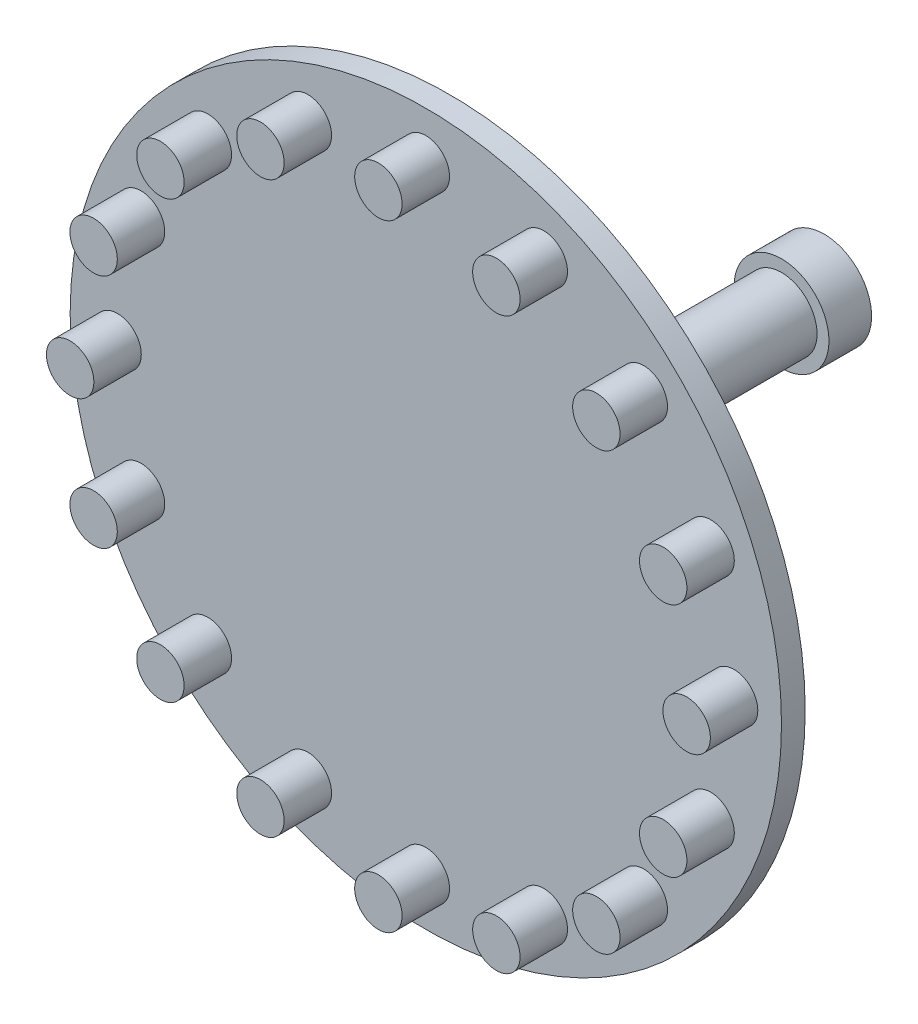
ISO-10303-21;
HEADER;
FILE_DESCRIPTION(('STEP AP214'),'2;1');
FILE_NAME('part.step','',(''),(''),'','','');
FILE_SCHEMA(('AUTOMOTIVE_DESIGN { 1 0 10303 214 1 1 1 1 }'));
ENDSEC;
DATA;
#1=APPLICATION_CONTEXT('core data for automotive mechanical design processes');
#2=APPLICATION_PROTOCOL_DEFINITION('international standard','automotive_design',2000,#1);
#3=PRODUCT_CONTEXT('',#1,'mechanical');
#4=PRODUCT('Part','Part','',(#3));
#5=PRODUCT_RELATED_PRODUCT_CATEGORY('part','',(#4));
#6=PRODUCT_DEFINITION_FORMATION('','',#4);
#7=PRODUCT_DEFINITION_CONTEXT('part definition',#1,'design');
#8=PRODUCT_DEFINITION('design','',#6,#7);
#9=PRODUCT_DEFINITION_SHAPE('','',#8);
#10=(LENGTH_UNIT() NAMED_UNIT(*) SI_UNIT(.MILLI.,.METRE.));
#11=(NAMED_UNIT(*) PLANE_ANGLE_UNIT() SI_UNIT($,.RADIAN.));
#12=(NAMED_UNIT(*) SI_UNIT($,.STERADIAN.) SOLID_ANGLE_UNIT());
#13=UNCERTAINTY_MEASURE_WITH_UNIT(LENGTH_MEASURE(1.E-05),#10,'distance_accuracy_value','');
#14=(GEOMETRIC_REPRESENTATION_CONTEXT(3) GLOBAL_UNCERTAINTY_ASSIGNED_CONTEXT((#13)) GLOBAL_UNIT_ASSIGNED_CONTEXT((#10,
#11,#12)) REPRESENTATION_CONTEXT('',''));
#15=CARTESIAN_POINT('',(0.,0.,0.));
#16=DIRECTION('',(0.,0.,1.));
#17=DIRECTION('',(1.,0.,0.));
#18=AXIS2_PLACEMENT_3D('',#15,#16,#17);
#19=CARTESIAN_POINT('',(0.,0.,70.));
#20=DIRECTION('',(0.,0.,-1.));
#21=DIRECTION('',(-1.,0.,0.));
#22=AXIS2_PLACEMENT_3D('',#19,#20,#21);
#23=CYLINDRICAL_SURFACE('',#22,7.5);
#24=CARTESIAN_POINT('',(0.,0.,70.));
#25=DIRECTION('',(0.,0.,1.));
#26=DIRECTION('',(1.,0.,0.));
#27=AXIS2_PLACEMENT_3D('',#24,#25,#26);
#28=CIRCLE('',#27,7.5);
#29=CARTESIAN_POINT('',(7.5,0.,70.));
#30=VERTEX_POINT('',#29);
#31=EDGE_CURVE('E11',#30,#30,#28,.T.);
#32=ORIENTED_EDGE('',*,*,#31,.F.);
#33=EDGE_LOOP('',(#32));
#34=FACE_BOUND('',#33,.T.);
#35=CARTESIAN_POINT('',(0.,0.,0.));
#36=DIRECTION('',(0.,0.,1.));
#37=DIRECTION('',(1.,0.,0.));
#38=AXIS2_PLACEMENT_3D('',#35,#36,#37);
#39=CIRCLE('',#38,7.5);
#40=CARTESIAN_POINT('',(7.5,0.,0.));
#41=VERTEX_POINT('',#40);
#42=EDGE_CURVE('E62',#41,#41,#39,.T.);
#43=ORIENTED_EDGE('',*,*,#42,.T.);
#44=EDGE_LOOP('',(#43));
#45=FACE_BOUND('',#44,.T.);
#46=ADVANCED_FACE('F59',(#34,#45),#23,.T.);
#47=CARTESIAN_POINT('',(0.,0.,75.));
#48=DIRECTION('',(0.,0.,-1.));
#49=DIRECTION('',(-1.,0.,0.));
#50=AXIS2_PLACEMENT_3D('',#47,#48,#49);
#51=CYLINDRICAL_SURFACE('',#50,75.);
#52=CARTESIAN_POINT('',(0.,0.,75.));
#53=DIRECTION('',(0.,0.,1.));
#54=DIRECTION('',(1.,0.,0.));
#55=AXIS2_PLACEMENT_3D('',#52,#53,#54);
#56=CIRCLE('',#55,75.);
#57=CARTESIAN_POINT('',(75.,0.,75.));
#58=VERTEX_POINT('',#57);
#59=EDGE_CURVE('E67',#58,#58,#56,.T.);
#60=ORIENTED_EDGE('',*,*,#59,.F.);
#61=EDGE_LOOP('',(#60));
#62=FACE_BOUND('',#61,.T.);
#63=CARTESIAN_POINT('',(0.,0.,70.));
#64=DIRECTION('',(0.,0.,1.));
#65=DIRECTION('',(1.,0.,0.));
#66=AXIS2_PLACEMENT_3D('',#63,#64,#65);
#67=CIRCLE('',#66,75.);
#68=CARTESIAN_POINT('',(75.,0.,70.));
#69=VERTEX_POINT('',#68);
#70=EDGE_CURVE('E72',#69,#69,#67,.T.);
#71=ORIENTED_EDGE('',*,*,#70,.T.);
#72=EDGE_LOOP('',(#71));
#73=FACE_BOUND('',#72,.T.);
#74=ADVANCED_FACE('F230',(#62,#73),#51,.T.);
#75=CARTESIAN_POINT('',(0.,0.,75.));
#76=DIRECTION('',(0.,0.,1.));
#77=DIRECTION('',(1.,0.,0.));
#78=AXIS2_PLACEMENT_3D('',#75,#76,#77);
#79=PLANE('',#78);
#80=CARTESIAN_POINT('',(45.9619407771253,-45.9619407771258,75.));
#81=DIRECTION('',(0.,0.,1.));
#82=DIRECTION('',(1.,0.,0.));
#83=AXIS2_PLACEMENT_3D('',#80,#81,#82);
#84=CIRCLE('',#83,4.99999999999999);
#85=CARTESIAN_POINT('',(50.9619407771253,-45.9619407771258,75.));
#86=VERTEX_POINT('',#85);
#87=EDGE_CURVE('E211',#86,#86,#84,.T.);
#88=ORIENTED_EDGE('',*,*,#87,.F.);
#89=EDGE_LOOP('',(#88));
#90=FACE_BOUND('',#89,.T.);
#91=CARTESIAN_POINT('',(60.0521696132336,-24.8744231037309,75.));
#92=DIRECTION('',(0.,0.,1.));
#93=DIRECTION('',(1.,0.,0.));
#94=AXIS2_PLACEMENT_3D('',#91,#92,#93);
#95=CIRCLE('',#94,5.);
#96=CARTESIAN_POINT('',(65.0521696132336,-24.8744231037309,75.));
#97=VERTEX_POINT('',#96);
#98=EDGE_CURVE('E203',#97,#97,#95,.T.);
#99=ORIENTED_EDGE('',*,*,#98,.F.);
#100=EDGE_LOOP('',(#99));
#101=FACE_BOUND('',#100,.T.);
#102=CARTESIAN_POINT('',(65.,0.,75.));
#103=DIRECTION('',(0.,0.,1.));
#104=DIRECTION('',(1.,0.,0.));
#105=AXIS2_PLACEMENT_3D('',#102,#103,#104);
#106=CIRCLE('',#105,5.);
#107=CARTESIAN_POINT('',(70.,0.,75.));
#108=VERTEX_POINT('',#107);
#109=EDGE_CURVE('E195',#108,#108,#106,.T.);
#110=ORIENTED_EDGE('',*,*,#109,.F.);
#111=EDGE_LOOP('',(#110));
#112=FACE_BOUND('',#111,.T.);
#113=CARTESIAN_POINT('',(60.0521696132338,24.8744231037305,75.));
#114=DIRECTION('',(0.,0.,1.));
#115=DIRECTION('',(1.,0.,0.));
#116=AXIS2_PLACEMENT_3D('',#113,#114,#115);
#117=CIRCLE('',#116,5.);
#118=CARTESIAN_POINT('',(65.0521696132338,24.8744231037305,75.));
#119=VERTEX_POINT('',#118);
#120=EDGE_CURVE('E187',#119,#119,#117,.T.);
#121=ORIENTED_EDGE('',*,*,#120,.F.);
#122=EDGE_LOOP('',(#121));
#123=FACE_BOUND('',#122,.T.);
#124=CARTESIAN_POINT('',(45.9619407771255,45.9619407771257,75.));
#125=DIRECTION('',(0.,0.,1.));
#126=DIRECTION('',(1.,0.,0.));
#127=AXIS2_PLACEMENT_3D('',#124,#125,#126);
#128=CIRCLE('',#127,5.);
#129=CARTESIAN_POINT('',(50.9619407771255,45.9619407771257,75.));
#130=VERTEX_POINT('',#129);
#131=EDGE_CURVE('E179',#130,#130,#128,.T.);
#132=ORIENTED_EDGE('',*,*,#131,.F.);
#133=EDGE_LOOP('',(#132));
#134=FACE_BOUND('',#133,.T.);
#135=CARTESIAN_POINT('',(24.8744231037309,60.0521696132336,75.));
#136=DIRECTION('',(0.,0.,1.));
#137=DIRECTION('',(1.,0.,0.));
#138=AXIS2_PLACEMENT_3D('',#135,#136,#137);
#139=CIRCLE('',#138,5.);
#140=CARTESIAN_POINT('',(29.8744231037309,60.0521696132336,75.));
#141=VERTEX_POINT('',#140);
#142=EDGE_CURVE('E171',#141,#141,#139,.T.);
#143=ORIENTED_EDGE('',*,*,#142,.F.);
#144=EDGE_LOOP('',(#143));
#145=FACE_BOUND('',#144,.T.);
#146=CARTESIAN_POINT('',(0.,65.,75.));
#147=DIRECTION('',(0.,0.,1.));
#148=DIRECTION('',(1.,0.,0.));
#149=AXIS2_PLACEMENT_3D('',#146,#147,#148);
#150=CIRCLE('',#149,5.);
#151=CARTESIAN_POINT('',(5.,65.,75.));
#152=VERTEX_POINT('',#151);
#153=EDGE_CURVE('E163',#152,#152,#150,.T.);
#154=ORIENTED_EDGE('',*,*,#153,.F.);
#155=EDGE_LOOP('',(#154));
#156=FACE_BOUND('',#155,.T.);
#157=CARTESIAN_POINT('',(-24.8744231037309,60.0521696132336,75.));
#158=DIRECTION('',(0.,0.,1.));
#159=DIRECTION('',(1.,0.,0.));
#160=AXIS2_PLACEMENT_3D('',#157,#158,#159);
#161=CIRCLE('',#160,5.);
#162=CARTESIAN_POINT('',(-19.8744231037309,60.0521696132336,75.));
#163=VERTEX_POINT('',#162);
#164=EDGE_CURVE('E155',#163,#163,#161,.T.);
#165=ORIENTED_EDGE('',*,*,#164,.F.);
#166=EDGE_LOOP('',(#165));
#167=FACE_BOUND('',#166,.T.);
#168=CARTESIAN_POINT('',(-45.9619407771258,45.9619407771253,75.));
#169=DIRECTION('',(0.,0.,1.));
#170=DIRECTION('',(1.,0.,0.));
#171=AXIS2_PLACEMENT_3D('',#168,#169,#170);
#172=CIRCLE('',#171,5.);
#173=CARTESIAN_POINT('',(-40.9619407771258,45.9619407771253,75.));
#174=VERTEX_POINT('',#173);
#175=EDGE_CURVE('E147',#174,#174,#172,.T.);
#176=ORIENTED_EDGE('',*,*,#175,.F.);
#177=EDGE_LOOP('',(#176));
#178=FACE_BOUND('',#177,.T.);
#179=CARTESIAN_POINT('',(-45.9619407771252,-45.961940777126,75.));
#180=DIRECTION('',(0.,0.,1.));
#181=DIRECTION('',(1.,0.,0.));
#182=AXIS2_PLACEMENT_3D('',#179,#180,#181);
#183=CIRCLE('',#182,5.);
#184=CARTESIAN_POINT('',(-40.9619407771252,-45.961940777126,75.));
#185=VERTEX_POINT('',#184);
#186=EDGE_CURVE('E139',#185,#185,#183,.T.);
#187=ORIENTED_EDGE('',*,*,#186,.F.);
#188=EDGE_LOOP('',(#187));
#189=FACE_BOUND('',#188,.T.);
#190=CARTESIAN_POINT('',(-60.0521696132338,-24.8744231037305,75.));
#191=DIRECTION('',(0.,0.,1.));
#192=DIRECTION('',(1.,0.,0.));
#193=AXIS2_PLACEMENT_3D('',#190,#191,#192);
#194=CIRCLE('',#193,5.);
#195=CARTESIAN_POINT('',(-55.0521696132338,-24.8744231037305,75.));
#196=VERTEX_POINT('',#195);
#197=EDGE_CURVE('E131',#196,#196,#194,.T.);
#198=ORIENTED_EDGE('',*,*,#197,.F.);
#199=EDGE_LOOP('',(#198));
#200=FACE_BOUND('',#199,.T.);
#201=CARTESIAN_POINT('',(-65.,0.,75.));
#202=DIRECTION('',(0.,0.,1.));
#203=DIRECTION('',(1.,0.,0.));
#204=AXIS2_PLACEMENT_3D('',#201,#202,#203);
#205=CIRCLE('',#204,5.);
#206=CARTESIAN_POINT('',(-60.,0.,75.));
#207=VERTEX_POINT('',#206);
#208=EDGE_CURVE('E123',#207,#207,#205,.T.);
#209=ORIENTED_EDGE('',*,*,#208,.F.);
#210=EDGE_LOOP('',(#209));
#211=FACE_BOUND('',#210,.T.);
#212=CARTESIAN_POINT('',(-60.0521696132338,24.8744231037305,75.));
#213=DIRECTION('',(0.,0.,1.));
#214=DIRECTION('',(1.,0.,0.));
#215=AXIS2_PLACEMENT_3D('',#212,#213,#214);
#216=CIRCLE('',#215,5.);
#217=CARTESIAN_POINT('',(-55.0521696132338,24.8744231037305,75.));
#218=VERTEX_POINT('',#217);
#219=EDGE_CURVE('E115',#218,#218,#216,.T.);
#220=ORIENTED_EDGE('',*,*,#219,.F.);
#221=EDGE_LOOP('',(#220));
#222=FACE_BOUND('',#221,.T.);
#223=CARTESIAN_POINT('',(24.8744231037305,-60.0521696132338,75.));
#224=DIRECTION('',(0.,0.,1.));
#225=DIRECTION('',(1.,0.,0.));
#226=AXIS2_PLACEMENT_3D('',#223,#224,#225);
#227=CIRCLE('',#226,5.);
#228=CARTESIAN_POINT('',(29.8744231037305,-60.0521696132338,75.));
#229=VERTEX_POINT('',#228);
#230=EDGE_CURVE('E107',#229,#229,#227,.T.);
#231=ORIENTED_EDGE('',*,*,#230,.F.);
#232=EDGE_LOOP('',(#231));
#233=FACE_BOUND('',#232,.T.);
#234=CARTESIAN_POINT('',(0.,-65.,75.));
#235=DIRECTION('',(0.,0.,1.));
#236=DIRECTION('',(1.,0.,0.));
#237=AXIS2_PLACEMENT_3D('',#234,#235,#236);
#238=CIRCLE('',#237,5.);
#239=CARTESIAN_POINT('',(5.,-65.,75.));
#240=VERTEX_POINT('',#239);
#241=EDGE_CURVE('E99',#240,#240,#238,.T.);
#242=ORIENTED_EDGE('',*,*,#241,.F.);
#243=EDGE_LOOP('',(#242));
#244=FACE_BOUND('',#243,.T.);
#245=CARTESIAN_POINT('',(-24.8744231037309,-60.0521696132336,75.));
#246=DIRECTION('',(0.,0.,1.));
#247=DIRECTION('',(1.,0.,0.));
#248=AXIS2_PLACEMENT_3D('',#245,#246,#247);
#249=CIRCLE('',#248,5.);
#250=CARTESIAN_POINT('',(-19.8744231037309,-60.0521696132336,75.));
#251=VERTEX_POINT('',#250);
#252=EDGE_CURVE('E95',#251,#251,#249,.T.);
#253=ORIENTED_EDGE('',*,*,#252,.F.);
#254=EDGE_LOOP('',(#253));
#255=FACE_BOUND('',#254,.T.);
#256=ORIENTED_EDGE('',*,*,#59,.T.);
#257=EDGE_LOOP('',(#256));
#258=FACE_BOUND('',#257,.T.);
#259=ADVANCED_FACE('F226',(#90,#101,#112,#123,#134,#145,#156,#167,#178,#189,#200,#211,#222,#233,
#244,#255,#258),#79,.T.);
#260=CARTESIAN_POINT('',(0.,0.,70.));
#261=DIRECTION('',(0.,0.,1.));
#262=DIRECTION('',(1.,0.,0.));
#263=AXIS2_PLACEMENT_3D('',#260,#261,#262);
#264=PLANE('',#263);
#265=ORIENTED_EDGE('',*,*,#31,.T.);
#266=EDGE_LOOP('',(#265));
#267=FACE_BOUND('',#266,.T.);
#268=ORIENTED_EDGE('',*,*,#70,.F.);
#269=EDGE_LOOP('',(#268));
#270=FACE_BOUND('',#269,.T.);
#271=ADVANCED_FACE('F229',(#267,#270),#264,.F.);
#272=CARTESIAN_POINT('',(0.,0.,-9.));
#273=DIRECTION('',(0.,0.,1.));
#274=DIRECTION('',(1.,0.,0.));
#275=AXIS2_PLACEMENT_3D('',#272,#273,#274);
#276=CYLINDRICAL_SURFACE('',#275,10.);
#277=CARTESIAN_POINT('',(0.,0.,-9.));
#278=DIRECTION('',(0.,0.,-1.));
#279=DIRECTION('',(-1.,0.,0.));
#280=AXIS2_PLACEMENT_3D('',#277,#278,#279);
#281=CIRCLE('',#280,10.);
#282=CARTESIAN_POINT('',(-10.,0.,-9.));
#283=VERTEX_POINT('',#282);
#284=EDGE_CURVE('E82',#283,#283,#281,.T.);
#285=ORIENTED_EDGE('',*,*,#284,.F.);
#286=EDGE_LOOP('',(#285));
#287=FACE_BOUND('',#286,.T.);
#288=CARTESIAN_POINT('',(0.,0.,0.));
#289=DIRECTION('',(0.,0.,-1.));
#290=DIRECTION('',(-1.,0.,0.));
#291=AXIS2_PLACEMENT_3D('',#288,#289,#290);
#292=CIRCLE('',#291,10.);
#293=CARTESIAN_POINT('',(-10.,0.,0.));
#294=VERTEX_POINT('',#293);
#295=EDGE_CURVE('E78',#294,#294,#292,.T.);
#296=ORIENTED_EDGE('',*,*,#295,.T.);
#297=EDGE_LOOP('',(#296));
#298=FACE_BOUND('',#297,.T.);
#299=ADVANCED_FACE('F269',(#287,#298),#276,.T.);
#300=CARTESIAN_POINT('',(0.,0.,-9.));
#301=DIRECTION('',(0.,0.,-1.));
#302=DIRECTION('',(-1.,0.,0.));
#303=AXIS2_PLACEMENT_3D('',#300,#301,#302);
#304=PLANE('',#303);
#305=CARTESIAN_POINT('',(0.,0.,-9.));
#306=DIRECTION('',(0.,0.,-1.));
#307=DIRECTION('',(-1.,0.,0.));
#308=AXIS2_PLACEMENT_3D('',#305,#306,#307);
#309=CIRCLE('',#308,2.5);
#310=CARTESIAN_POINT('',(-2.5,0.,-9.));
#311=VERTEX_POINT('',#310);
#312=EDGE_CURVE('E87',#311,#311,#309,.T.);
#313=ORIENTED_EDGE('',*,*,#312,.F.);
#314=EDGE_LOOP('',(#313));
#315=FACE_BOUND('',#314,.T.);
#316=ORIENTED_EDGE('',*,*,#284,.T.);
#317=EDGE_LOOP('',(#316));
#318=FACE_BOUND('',#317,.T.);
#319=ADVANCED_FACE('F274',(#315,#318),#304,.T.);
#320=CARTESIAN_POINT('',(0.,0.,0.));
#321=DIRECTION('',(0.,0.,-1.));
#322=DIRECTION('',(-1.,0.,0.));
#323=AXIS2_PLACEMENT_3D('',#320,#321,#322);
#324=PLANE('',#323);
#325=ORIENTED_EDGE('',*,*,#42,.F.);
#326=EDGE_LOOP('',(#325));
#327=FACE_BOUND('',#326,.T.);
#328=ORIENTED_EDGE('',*,*,#295,.F.);
#329=EDGE_LOOP('',(#328));
#330=FACE_BOUND('',#329,.T.);
#331=ADVANCED_FACE('F286',(#327,#330),#324,.F.);
#332=CARTESIAN_POINT('',(0.,0.,-4.));
#333=DIRECTION('',(0.,0.,-1.));
#334=DIRECTION('',(-1.,0.,0.));
#335=AXIS2_PLACEMENT_3D('',#332,#333,#334);
#336=CYLINDRICAL_SURFACE('',#335,2.5);
#337=CARTESIAN_POINT('',(0.,0.,-4.));
#338=DIRECTION('',(0.,0.,-1.));
#339=DIRECTION('',(-1.,0.,0.));
#340=AXIS2_PLACEMENT_3D('',#337,#338,#339);
#341=CIRCLE('',#340,2.5);
#342=CARTESIAN_POINT('',(-2.5,0.,-4.));
#343=VERTEX_POINT('',#342);
#344=EDGE_CURVE('E83',#343,#343,#341,.T.);
#345=ORIENTED_EDGE('',*,*,#344,.F.);
#346=EDGE_LOOP('',(#345));
#347=FACE_BOUND('',#346,.T.);
#348=ORIENTED_EDGE('',*,*,#312,.T.);
#349=EDGE_LOOP('',(#348));
#350=FACE_BOUND('',#349,.T.);
#351=ADVANCED_FACE('F289',(#347,#350),#336,.F.);
#352=CARTESIAN_POINT('',(0.,0.,-4.));
#353=DIRECTION('',(0.,0.,-1.));
#354=DIRECTION('',(-1.,0.,0.));
#355=AXIS2_PLACEMENT_3D('',#352,#353,#354);
#356=PLANE('',#355);
#357=ORIENTED_EDGE('',*,*,#344,.T.);
#358=EDGE_LOOP('',(#357));
#359=FACE_BOUND('',#358,.T.);
#360=ADVANCED_FACE('F297',(#359),#356,.T.);
#361=CARTESIAN_POINT('',(-24.8744231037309,-60.0521696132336,85.));
#362=DIRECTION('',(0.,0.,-1.));
#363=DIRECTION('',(-1.,0.,0.));
#364=AXIS2_PLACEMENT_3D('',#361,#362,#363);
#365=CYLINDRICAL_SURFACE('',#364,5.);
#366=CARTESIAN_POINT('',(-24.8744231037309,-60.0521696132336,85.));
#367=DIRECTION('',(0.,0.,1.));
#368=DIRECTION('',(1.,0.,0.));
#369=AXIS2_PLACEMENT_3D('',#366,#367,#368);
#370=CIRCLE('',#369,5.);
#371=CARTESIAN_POINT('',(-19.8744231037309,-60.0521696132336,85.));
#372=VERTEX_POINT('',#371);
#373=EDGE_CURVE('E91',#372,#372,#370,.T.);
#374=ORIENTED_EDGE('',*,*,#373,.F.);
#375=EDGE_LOOP('',(#374));
#376=FACE_BOUND('',#375,.T.);
#377=ORIENTED_EDGE('',*,*,#252,.T.);
#378=EDGE_LOOP('',(#377));
#379=FACE_BOUND('',#378,.T.);
#380=ADVANCED_FACE('F305',(#376,#379),#365,.T.);
#381=CARTESIAN_POINT('',(0.,0.,85.));
#382=DIRECTION('',(0.,0.,1.));
#383=DIRECTION('',(1.,0.,0.));
#384=AXIS2_PLACEMENT_3D('',#381,#382,#383);
#385=PLANE('',#384);
#386=ORIENTED_EDGE('',*,*,#373,.T.);
#387=EDGE_LOOP('',(#386));
#388=FACE_BOUND('',#387,.T.);
#389=ADVANCED_FACE('F309',(#388),#385,.T.);
#390=CARTESIAN_POINT('',(0.,-65.,85.));
#391=DIRECTION('',(0.,0.,-1.));
#392=DIRECTION('',(-1.,0.,0.));
#393=AXIS2_PLACEMENT_3D('',#390,#391,#392);
#394=CYLINDRICAL_SURFACE('',#393,5.);
#395=CARTESIAN_POINT('',(0.,-65.,85.));
#396=DIRECTION('',(0.,0.,1.));
#397=DIRECTION('',(1.,0.,0.));
#398=AXIS2_PLACEMENT_3D('',#395,#396,#397);
#399=CIRCLE('',#398,5.);
#400=CARTESIAN_POINT('',(5.,-65.,85.));
#401=VERTEX_POINT('',#400);
#402=EDGE_CURVE('E103',#401,#401,#399,.T.);
#403=ORIENTED_EDGE('',*,*,#402,.F.);
#404=EDGE_LOOP('',(#403));
#405=FACE_BOUND('',#404,.T.);
#406=ORIENTED_EDGE('',*,*,#241,.T.);
#407=EDGE_LOOP('',(#406));
#408=FACE_BOUND('',#407,.T.);
#409=ADVANCED_FACE('F313',(#405,#408),#394,.T.);
#410=CARTESIAN_POINT('',(0.,0.,85.));
#411=DIRECTION('',(0.,0.,1.));
#412=DIRECTION('',(1.,0.,0.));
#413=AXIS2_PLACEMENT_3D('',#410,#411,#412);
#414=PLANE('',#413);
#415=ORIENTED_EDGE('',*,*,#402,.T.);
#416=EDGE_LOOP('',(#415));
#417=FACE_BOUND('',#416,.T.);
#418=ADVANCED_FACE('F315',(#417),#414,.T.);
#419=CARTESIAN_POINT('',(24.8744231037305,-60.0521696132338,85.));
#420=DIRECTION('',(0.,0.,-1.));
#421=DIRECTION('',(-1.,0.,0.));
#422=AXIS2_PLACEMENT_3D('',#419,#420,#421);
#423=CYLINDRICAL_SURFACE('',#422,5.);
#424=CARTESIAN_POINT('',(24.8744231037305,-60.0521696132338,85.));
#425=DIRECTION('',(0.,0.,1.));
#426=DIRECTION('',(1.,0.,0.));
#427=AXIS2_PLACEMENT_3D('',#424,#425,#426);
#428=CIRCLE('',#427,5.);
#429=CARTESIAN_POINT('',(29.8744231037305,-60.0521696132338,85.));
#430=VERTEX_POINT('',#429);
#431=EDGE_CURVE('E111',#430,#430,#428,.T.);
#432=ORIENTED_EDGE('',*,*,#431,.F.);
#433=EDGE_LOOP('',(#432));
#434=FACE_BOUND('',#433,.T.);
#435=ORIENTED_EDGE('',*,*,#230,.T.);
#436=EDGE_LOOP('',(#435));
#437=FACE_BOUND('',#436,.T.);
#438=ADVANCED_FACE('F318',(#434,#437),#423,.T.);
#439=CARTESIAN_POINT('',(0.,0.,85.));
#440=DIRECTION('',(0.,0.,1.));
#441=DIRECTION('',(1.,0.,0.));
#442=AXIS2_PLACEMENT_3D('',#439,#440,#441);
#443=PLANE('',#442);
#444=ORIENTED_EDGE('',*,*,#431,.T.);
#445=EDGE_LOOP('',(#444));
#446=FACE_BOUND('',#445,.T.);
#447=ADVANCED_FACE('F323',(#446),#443,.T.);
#448=CARTESIAN_POINT('',(-60.0521696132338,24.8744231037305,85.));
#449=DIRECTION('',(0.,0.,-1.));
#450=DIRECTION('',(-1.,0.,0.));
#451=AXIS2_PLACEMENT_3D('',#448,#449,#450);
#452=CYLINDRICAL_SURFACE('',#451,5.);
#453=ORIENTED_EDGE('',*,*,#219,.T.);
#454=EDGE_LOOP('',(#453));
#455=FACE_BOUND('',#454,.T.);
#456=CARTESIAN_POINT('',(-60.0521696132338,24.8744231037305,85.));
#457=DIRECTION('',(0.,0.,1.));
#458=DIRECTION('',(1.,0.,0.));
#459=AXIS2_PLACEMENT_3D('',#456,#457,#458);
#460=CIRCLE('',#459,5.);
#461=CARTESIAN_POINT('',(-55.0521696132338,24.8744231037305,85.));
#462=VERTEX_POINT('',#461);
#463=EDGE_CURVE('E119',#462,#462,#460,.T.);
#464=ORIENTED_EDGE('',*,*,#463,.F.);
#465=EDGE_LOOP('',(#464));
#466=FACE_BOUND('',#465,.T.);
#467=ADVANCED_FACE('F326',(#455,#466),#452,.T.);
#468=CARTESIAN_POINT('',(0.,0.,85.));
#469=DIRECTION('',(0.,0.,1.));
#470=DIRECTION('',(1.,0.,0.));
#471=AXIS2_PLACEMENT_3D('',#468,#469,#470);
#472=PLANE('',#471);
#473=ORIENTED_EDGE('',*,*,#463,.T.);
#474=EDGE_LOOP('',(#473));
#475=FACE_BOUND('',#474,.T.);
#476=ADVANCED_FACE('F331',(#475),#472,.T.);
#477=CARTESIAN_POINT('',(-65.,0.,85.));
#478=DIRECTION('',(0.,0.,-1.));
#479=DIRECTION('',(-1.,0.,0.));
#480=AXIS2_PLACEMENT_3D('',#477,#478,#479);
#481=CYLINDRICAL_SURFACE('',#480,5.);
#482=CARTESIAN_POINT('',(-65.,0.,85.));
#483=DIRECTION('',(0.,0.,1.));
#484=DIRECTION('',(1.,0.,0.));
#485=AXIS2_PLACEMENT_3D('',#482,#483,#484);
#486=CIRCLE('',#485,5.);
#487=CARTESIAN_POINT('',(-60.,0.,85.));
#488=VERTEX_POINT('',#487);
#489=EDGE_CURVE('E127',#488,#488,#486,.T.);
#490=ORIENTED_EDGE('',*,*,#489,.F.);
#491=EDGE_LOOP('',(#490));
#492=FACE_BOUND('',#491,.T.);
#493=ORIENTED_EDGE('',*,*,#208,.T.);
#494=EDGE_LOOP('',(#493));
#495=FACE_BOUND('',#494,.T.);
#496=ADVANCED_FACE('F334',(#492,#495),#481,.T.);
#497=CARTESIAN_POINT('',(0.,0.,85.));
#498=DIRECTION('',(0.,0.,1.));
#499=DIRECTION('',(1.,0.,0.));
#500=AXIS2_PLACEMENT_3D('',#497,#498,#499);
#501=PLANE('',#500);
#502=ORIENTED_EDGE('',*,*,#489,.T.);
#503=EDGE_LOOP('',(#502));
#504=FACE_BOUND('',#503,.T.);
#505=ADVANCED_FACE('F339',(#504),#501,.T.);
#506=CARTESIAN_POINT('',(-60.0521696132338,-24.8744231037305,85.));
#507=DIRECTION('',(0.,0.,-1.));
#508=DIRECTION('',(-1.,0.,0.));
#509=AXIS2_PLACEMENT_3D('',#506,#507,#508);
#510=CYLINDRICAL_SURFACE('',#509,5.);
#511=CARTESIAN_POINT('',(-60.0521696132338,-24.8744231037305,85.));
#512=DIRECTION('',(0.,0.,1.));
#513=DIRECTION('',(1.,0.,0.));
#514=AXIS2_PLACEMENT_3D('',#511,#512,#513);
#515=CIRCLE('',#514,5.);
#516=CARTESIAN_POINT('',(-55.0521696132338,-24.8744231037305,85.));
#517=VERTEX_POINT('',#516);
#518=EDGE_CURVE('E135',#517,#517,#515,.T.);
#519=ORIENTED_EDGE('',*,*,#518,.F.);
#520=EDGE_LOOP('',(#519));
#521=FACE_BOUND('',#520,.T.);
#522=ORIENTED_EDGE('',*,*,#197,.T.);
#523=EDGE_LOOP('',(#522));
#524=FACE_BOUND('',#523,.T.);
#525=ADVANCED_FACE('F342',(#521,#524),#510,.T.);
#526=CARTESIAN_POINT('',(0.,0.,85.));
#527=DIRECTION('',(0.,0.,1.));
#528=DIRECTION('',(1.,0.,0.));
#529=AXIS2_PLACEMENT_3D('',#526,#527,#528);
#530=PLANE('',#529);
#531=ORIENTED_EDGE('',*,*,#518,.T.);
#532=EDGE_LOOP('',(#531));
#533=FACE_BOUND('',#532,.T.);
#534=ADVANCED_FACE('F347',(#533),#530,.T.);
#535=CARTESIAN_POINT('',(-45.9619407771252,-45.961940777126,85.));
#536=DIRECTION('',(0.,0.,-1.));
#537=DIRECTION('',(-1.,0.,0.));
#538=AXIS2_PLACEMENT_3D('',#535,#536,#537);
#539=CYLINDRICAL_SURFACE('',#538,5.);
#540=CARTESIAN_POINT('',(-45.9619407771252,-45.961940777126,85.));
#541=DIRECTION('',(0.,0.,1.));
#542=DIRECTION('',(1.,0.,0.));
#543=AXIS2_PLACEMENT_3D('',#540,#541,#542);
#544=CIRCLE('',#543,5.);
#545=CARTESIAN_POINT('',(-40.9619407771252,-45.961940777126,85.));
#546=VERTEX_POINT('',#545);
#547=EDGE_CURVE('E143',#546,#546,#544,.T.);
#548=ORIENTED_EDGE('',*,*,#547,.F.);
#549=EDGE_LOOP('',(#548));
#550=FACE_BOUND('',#549,.T.);
#551=ORIENTED_EDGE('',*,*,#186,.T.);
#552=EDGE_LOOP('',(#551));
#553=FACE_BOUND('',#552,.T.);
#554=ADVANCED_FACE('F350',(#550,#553),#539,.T.);
#555=CARTESIAN_POINT('',(0.,0.,85.));
#556=DIRECTION('',(0.,0.,1.));
#557=DIRECTION('',(1.,0.,0.));
#558=AXIS2_PLACEMENT_3D('',#555,#556,#557);
#559=PLANE('',#558);
#560=ORIENTED_EDGE('',*,*,#547,.T.);
#561=EDGE_LOOP('',(#560));
#562=FACE_BOUND('',#561,.T.);
#563=ADVANCED_FACE('F355',(#562),#559,.T.);
#564=CARTESIAN_POINT('',(-45.9619407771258,45.9619407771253,85.));
#565=DIRECTION('',(0.,0.,-1.));
#566=DIRECTION('',(-1.,0.,0.));
#567=AXIS2_PLACEMENT_3D('',#564,#565,#566);
#568=CYLINDRICAL_SURFACE('',#567,5.);
#569=CARTESIAN_POINT('',(-45.9619407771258,45.9619407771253,85.));
#570=DIRECTION('',(0.,0.,1.));
#571=DIRECTION('',(1.,0.,0.));
#572=AXIS2_PLACEMENT_3D('',#569,#570,#571);
#573=CIRCLE('',#572,5.);
#574=CARTESIAN_POINT('',(-40.9619407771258,45.9619407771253,85.));
#575=VERTEX_POINT('',#574);
#576=EDGE_CURVE('E151',#575,#575,#573,.T.);
#577=ORIENTED_EDGE('',*,*,#576,.F.);
#578=EDGE_LOOP('',(#577));
#579=FACE_BOUND('',#578,.T.);
#580=ORIENTED_EDGE('',*,*,#175,.T.);
#581=EDGE_LOOP('',(#580));
#582=FACE_BOUND('',#581,.T.);
#583=ADVANCED_FACE('F358',(#579,#582),#568,.T.);
#584=CARTESIAN_POINT('',(0.,0.,85.));
#585=DIRECTION('',(0.,0.,1.));
#586=DIRECTION('',(1.,0.,0.));
#587=AXIS2_PLACEMENT_3D('',#584,#585,#586);
#588=PLANE('',#587);
#589=ORIENTED_EDGE('',*,*,#576,.T.);
#590=EDGE_LOOP('',(#589));
#591=FACE_BOUND('',#590,.T.);
#592=ADVANCED_FACE('F363',(#591),#588,.T.);
#593=CARTESIAN_POINT('',(-24.8744231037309,60.0521696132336,85.));
#594=DIRECTION('',(0.,0.,-1.));
#595=DIRECTION('',(-1.,0.,0.));
#596=AXIS2_PLACEMENT_3D('',#593,#594,#595);
#597=CYLINDRICAL_SURFACE('',#596,5.);
#598=CARTESIAN_POINT('',(-24.8744231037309,60.0521696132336,85.));
#599=DIRECTION('',(0.,0.,1.));
#600=DIRECTION('',(1.,0.,0.));
#601=AXIS2_PLACEMENT_3D('',#598,#599,#600);
#602=CIRCLE('',#601,5.);
#603=CARTESIAN_POINT('',(-19.8744231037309,60.0521696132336,85.));
#604=VERTEX_POINT('',#603);
#605=EDGE_CURVE('E159',#604,#604,#602,.T.);
#606=ORIENTED_EDGE('',*,*,#605,.F.);
#607=EDGE_LOOP('',(#606));
#608=FACE_BOUND('',#607,.T.);
#609=ORIENTED_EDGE('',*,*,#164,.T.);
#610=EDGE_LOOP('',(#609));
#611=FACE_BOUND('',#610,.T.);
#612=ADVANCED_FACE('F366',(#608,#611),#597,.T.);
#613=CARTESIAN_POINT('',(0.,0.,85.));
#614=DIRECTION('',(0.,0.,1.));
#615=DIRECTION('',(1.,0.,0.));
#616=AXIS2_PLACEMENT_3D('',#613,#614,#615);
#617=PLANE('',#616);
#618=ORIENTED_EDGE('',*,*,#605,.T.);
#619=EDGE_LOOP('',(#618));
#620=FACE_BOUND('',#619,.T.);
#621=ADVANCED_FACE('F371',(#620),#617,.T.);
#622=CARTESIAN_POINT('',(0.,65.,85.));
#623=DIRECTION('',(0.,0.,-1.));
#624=DIRECTION('',(-1.,0.,0.));
#625=AXIS2_PLACEMENT_3D('',#622,#623,#624);
#626=CYLINDRICAL_SURFACE('',#625,5.);
#627=CARTESIAN_POINT('',(0.,65.,85.));
#628=DIRECTION('',(0.,0.,1.));
#629=DIRECTION('',(1.,0.,0.));
#630=AXIS2_PLACEMENT_3D('',#627,#628,#629);
#631=CIRCLE('',#630,5.);
#632=CARTESIAN_POINT('',(5.,65.,85.));
#633=VERTEX_POINT('',#632);
#634=EDGE_CURVE('E167',#633,#633,#631,.T.);
#635=ORIENTED_EDGE('',*,*,#634,.F.);
#636=EDGE_LOOP('',(#635));
#637=FACE_BOUND('',#636,.T.);
#638=ORIENTED_EDGE('',*,*,#153,.T.);
#639=EDGE_LOOP('',(#638));
#640=FACE_BOUND('',#639,.T.);
#641=ADVANCED_FACE('F374',(#637,#640),#626,.T.);
#642=CARTESIAN_POINT('',(0.,0.,85.));
#643=DIRECTION('',(0.,0.,1.));
#644=DIRECTION('',(1.,0.,0.));
#645=AXIS2_PLACEMENT_3D('',#642,#643,#644);
#646=PLANE('',#645);
#647=ORIENTED_EDGE('',*,*,#634,.T.);
#648=EDGE_LOOP('',(#647));
#649=FACE_BOUND('',#648,.T.);
#650=ADVANCED_FACE('F379',(#649),#646,.T.);
#651=CARTESIAN_POINT('',(24.8744231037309,60.0521696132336,85.));
#652=DIRECTION('',(0.,0.,-1.));
#653=DIRECTION('',(-1.,0.,0.));
#654=AXIS2_PLACEMENT_3D('',#651,#652,#653);
#655=CYLINDRICAL_SURFACE('',#654,5.);
#656=CARTESIAN_POINT('',(24.8744231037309,60.0521696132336,85.));
#657=DIRECTION('',(0.,0.,1.));
#658=DIRECTION('',(1.,0.,0.));
#659=AXIS2_PLACEMENT_3D('',#656,#657,#658);
#660=CIRCLE('',#659,5.);
#661=CARTESIAN_POINT('',(29.8744231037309,60.0521696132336,85.));
#662=VERTEX_POINT('',#661);
#663=EDGE_CURVE('E175',#662,#662,#660,.T.);
#664=ORIENTED_EDGE('',*,*,#663,.F.);
#665=EDGE_LOOP('',(#664));
#666=FACE_BOUND('',#665,.T.);
#667=ORIENTED_EDGE('',*,*,#142,.T.);
#668=EDGE_LOOP('',(#667));
#669=FACE_BOUND('',#668,.T.);
#670=ADVANCED_FACE('F382',(#666,#669),#655,.T.);
#671=CARTESIAN_POINT('',(0.,0.,85.));
#672=DIRECTION('',(0.,0.,1.));
#673=DIRECTION('',(1.,0.,0.));
#674=AXIS2_PLACEMENT_3D('',#671,#672,#673);
#675=PLANE('',#674);
#676=ORIENTED_EDGE('',*,*,#663,.T.);
#677=EDGE_LOOP('',(#676));
#678=FACE_BOUND('',#677,.T.);
#679=ADVANCED_FACE('F387',(#678),#675,.T.);
#680=CARTESIAN_POINT('',(45.9619407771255,45.9619407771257,85.));
#681=DIRECTION('',(0.,0.,-1.));
#682=DIRECTION('',(-1.,0.,0.));
#683=AXIS2_PLACEMENT_3D('',#680,#681,#682);
#684=CYLINDRICAL_SURFACE('',#683,5.);
#685=CARTESIAN_POINT('',(45.9619407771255,45.9619407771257,85.));
#686=DIRECTION('',(0.,0.,1.));
#687=DIRECTION('',(1.,0.,0.));
#688=AXIS2_PLACEMENT_3D('',#685,#686,#687);
#689=CIRCLE('',#688,5.);
#690=CARTESIAN_POINT('',(50.9619407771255,45.9619407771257,85.));
#691=VERTEX_POINT('',#690);
#692=EDGE_CURVE('E183',#691,#691,#689,.T.);
#693=ORIENTED_EDGE('',*,*,#692,.F.);
#694=EDGE_LOOP('',(#693));
#695=FACE_BOUND('',#694,.T.);
#696=ORIENTED_EDGE('',*,*,#131,.T.);
#697=EDGE_LOOP('',(#696));
#698=FACE_BOUND('',#697,.T.);
#699=ADVANCED_FACE('F390',(#695,#698),#684,.T.);
#700=CARTESIAN_POINT('',(0.,0.,85.));
#701=DIRECTION('',(0.,0.,1.));
#702=DIRECTION('',(1.,0.,0.));
#703=AXIS2_PLACEMENT_3D('',#700,#701,#702);
#704=PLANE('',#703);
#705=ORIENTED_EDGE('',*,*,#692,.T.);
#706=EDGE_LOOP('',(#705));
#707=FACE_BOUND('',#706,.T.);
#708=ADVANCED_FACE('F395',(#707),#704,.T.);
#709=CARTESIAN_POINT('',(60.0521696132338,24.8744231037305,85.));
#710=DIRECTION('',(0.,0.,-1.));
#711=DIRECTION('',(-1.,0.,0.));
#712=AXIS2_PLACEMENT_3D('',#709,#710,#711);
#713=CYLINDRICAL_SURFACE('',#712,5.);
#714=CARTESIAN_POINT('',(60.0521696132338,24.8744231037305,85.));
#715=DIRECTION('',(0.,0.,1.));
#716=DIRECTION('',(1.,0.,0.));
#717=AXIS2_PLACEMENT_3D('',#714,#715,#716);
#718=CIRCLE('',#717,5.);
#719=CARTESIAN_POINT('',(65.0521696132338,24.8744231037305,85.));
#720=VERTEX_POINT('',#719);
#721=EDGE_CURVE('E191',#720,#720,#718,.T.);
#722=ORIENTED_EDGE('',*,*,#721,.F.);
#723=EDGE_LOOP('',(#722));
#724=FACE_BOUND('',#723,.T.);
#725=ORIENTED_EDGE('',*,*,#120,.T.);
#726=EDGE_LOOP('',(#725));
#727=FACE_BOUND('',#726,.T.);
#728=ADVANCED_FACE('F398',(#724,#727),#713,.T.);
#729=CARTESIAN_POINT('',(0.,0.,85.));
#730=DIRECTION('',(0.,0.,1.));
#731=DIRECTION('',(1.,0.,0.));
#732=AXIS2_PLACEMENT_3D('',#729,#730,#731);
#733=PLANE('',#732);
#734=ORIENTED_EDGE('',*,*,#721,.T.);
#735=EDGE_LOOP('',(#734));
#736=FACE_BOUND('',#735,.T.);
#737=ADVANCED_FACE('F403',(#736),#733,.T.);
#738=CARTESIAN_POINT('',(65.,0.,85.));
#739=DIRECTION('',(0.,0.,-1.));
#740=DIRECTION('',(-1.,0.,0.));
#741=AXIS2_PLACEMENT_3D('',#738,#739,#740);
#742=CYLINDRICAL_SURFACE('',#741,5.);
#743=CARTESIAN_POINT('',(65.,0.,85.));
#744=DIRECTION('',(0.,0.,1.));
#745=DIRECTION('',(1.,0.,0.));
#746=AXIS2_PLACEMENT_3D('',#743,#744,#745);
#747=CIRCLE('',#746,5.);
#748=CARTESIAN_POINT('',(70.,0.,85.));
#749=VERTEX_POINT('',#748);
#750=EDGE_CURVE('E199',#749,#749,#747,.T.);
#751=ORIENTED_EDGE('',*,*,#750,.F.);
#752=EDGE_LOOP('',(#751));
#753=FACE_BOUND('',#752,.T.);
#754=ORIENTED_EDGE('',*,*,#109,.T.);
#755=EDGE_LOOP('',(#754));
#756=FACE_BOUND('',#755,.T.);
#757=ADVANCED_FACE('F406',(#753,#756),#742,.T.);
#758=CARTESIAN_POINT('',(0.,0.,85.));
#759=DIRECTION('',(0.,0.,1.));
#760=DIRECTION('',(1.,0.,0.));
#761=AXIS2_PLACEMENT_3D('',#758,#759,#760);
#762=PLANE('',#761);
#763=ORIENTED_EDGE('',*,*,#750,.T.);
#764=EDGE_LOOP('',(#763));
#765=FACE_BOUND('',#764,.T.);
#766=ADVANCED_FACE('F411',(#765),#762,.T.);
#767=CARTESIAN_POINT('',(60.0521696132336,-24.8744231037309,85.));
#768=DIRECTION('',(0.,0.,-1.));
#769=DIRECTION('',(-1.,0.,0.));
#770=AXIS2_PLACEMENT_3D('',#767,#768,#769);
#771=CYLINDRICAL_SURFACE('',#770,5.);
#772=CARTESIAN_POINT('',(60.0521696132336,-24.8744231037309,85.));
#773=DIRECTION('',(0.,0.,1.));
#774=DIRECTION('',(1.,0.,0.));
#775=AXIS2_PLACEMENT_3D('',#772,#773,#774);
#776=CIRCLE('',#775,5.);
#777=CARTESIAN_POINT('',(65.0521696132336,-24.8744231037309,85.));
#778=VERTEX_POINT('',#777);
#779=EDGE_CURVE('E207',#778,#778,#776,.T.);
#780=ORIENTED_EDGE('',*,*,#779,.F.);
#781=EDGE_LOOP('',(#780));
#782=FACE_BOUND('',#781,.T.);
#783=ORIENTED_EDGE('',*,*,#98,.T.);
#784=EDGE_LOOP('',(#783));
#785=FACE_BOUND('',#784,.T.);
#786=ADVANCED_FACE('F414',(#782,#785),#771,.T.);
#787=CARTESIAN_POINT('',(0.,0.,85.));
#788=DIRECTION('',(0.,0.,1.));
#789=DIRECTION('',(1.,0.,0.));
#790=AXIS2_PLACEMENT_3D('',#787,#788,#789);
#791=PLANE('',#790);
#792=ORIENTED_EDGE('',*,*,#779,.T.);
#793=EDGE_LOOP('',(#792));
#794=FACE_BOUND('',#793,.T.);
#795=ADVANCED_FACE('F419',(#794),#791,.T.);
#796=CARTESIAN_POINT('',(45.9619407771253,-45.9619407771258,85.));
#797=DIRECTION('',(0.,0.,-1.));
#798=DIRECTION('',(-1.,0.,0.));
#799=AXIS2_PLACEMENT_3D('',#796,#797,#798);
#800=CYLINDRICAL_SURFACE('',#799,4.99999999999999);
#801=ORIENTED_EDGE('',*,*,#87,.T.);
#802=EDGE_LOOP('',(#801));
#803=FACE_BOUND('',#802,.T.);
#804=CARTESIAN_POINT('',(45.9619407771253,-45.9619407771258,85.));
#805=DIRECTION('',(0.,0.,1.));
#806=DIRECTION('',(1.,0.,0.));
#807=AXIS2_PLACEMENT_3D('',#804,#805,#806);
#808=CIRCLE('',#807,4.99999999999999);
#809=CARTESIAN_POINT('',(50.9619407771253,-45.9619407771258,85.));
#810=VERTEX_POINT('',#809);
#811=EDGE_CURVE('E215',#810,#810,#808,.T.);
#812=ORIENTED_EDGE('',*,*,#811,.F.);
#813=EDGE_LOOP('',(#812));
#814=FACE_BOUND('',#813,.T.);
#815=ADVANCED_FACE('F223',(#803,#814),#800,.T.);
#816=CARTESIAN_POINT('',(0.,0.,85.));
#817=DIRECTION('',(0.,0.,1.));
#818=DIRECTION('',(1.,0.,0.));
#819=AXIS2_PLACEMENT_3D('',#816,#817,#818);
#820=PLANE('',#819);
#821=ORIENTED_EDGE('',*,*,#811,.T.);
#822=EDGE_LOOP('',(#821));
#823=FACE_BOUND('',#822,.T.);
#824=ADVANCED_FACE('F426',(#823),#820,.T.);
#825=CLOSED_SHELL('',(#46,#74,#259,#271,#299,#319,#331,#351,#360,#380,#389,#409,#418,#438,#447,
#467,#476,#496,#505,#525,#534,#554,#563,#583,#592,#612,#621,#641,#650,#670,#679,#699,#708,#728,
#737,#757,#766,#786,#795,#815,#824));
#826=MANIFOLD_SOLID_BREP('B2',#825);
#827=ADVANCED_BREP_SHAPE_REPRESENTATION('',(#18,#826),#14);
#828=SHAPE_DEFINITION_REPRESENTATION(#9,#827);
ENDSEC;
END-ISO-10303-21;
